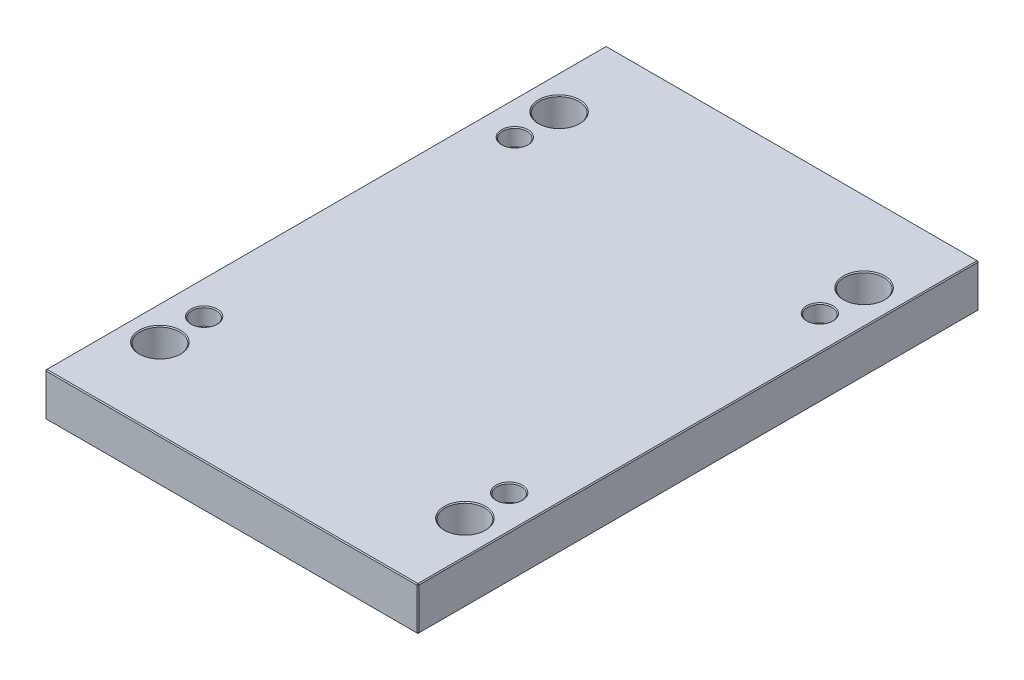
ISO-10303-21;
HEADER;
FILE_DESCRIPTION(('STEP AP214'),'2;1');
FILE_NAME('part.step','',(''),(''),'','','');
FILE_SCHEMA(('AUTOMOTIVE_DESIGN { 1 0 10303 214 1 1 1 1 }'));
ENDSEC;
DATA;
#1=APPLICATION_CONTEXT('core data for automotive mechanical design processes');
#2=APPLICATION_PROTOCOL_DEFINITION('international standard','automotive_design',2000,#1);
#3=PRODUCT_CONTEXT('',#1,'mechanical');
#4=PRODUCT('Part','Part','',(#3));
#5=PRODUCT_RELATED_PRODUCT_CATEGORY('part','',(#4));
#6=PRODUCT_DEFINITION_FORMATION('','',#4);
#7=PRODUCT_DEFINITION_CONTEXT('part definition',#1,'design');
#8=PRODUCT_DEFINITION('design','',#6,#7);
#9=PRODUCT_DEFINITION_SHAPE('','',#8);
#10=(LENGTH_UNIT() NAMED_UNIT(*) SI_UNIT(.MILLI.,.METRE.));
#11=(NAMED_UNIT(*) PLANE_ANGLE_UNIT() SI_UNIT($,.RADIAN.));
#12=(NAMED_UNIT(*) SI_UNIT($,.STERADIAN.) SOLID_ANGLE_UNIT());
#13=UNCERTAINTY_MEASURE_WITH_UNIT(LENGTH_MEASURE(1.E-05),#10,'distance_accuracy_value','');
#14=(GEOMETRIC_REPRESENTATION_CONTEXT(3) GLOBAL_UNCERTAINTY_ASSIGNED_CONTEXT((#13)) GLOBAL_UNIT_ASSIGNED_CONTEXT((#10,
#11,#12)) REPRESENTATION_CONTEXT('',''));
#15=CARTESIAN_POINT('',(0.,0.,0.));
#16=DIRECTION('',(0.,0.,1.));
#17=DIRECTION('',(1.,0.,0.));
#18=AXIS2_PLACEMENT_3D('',#15,#16,#17);
#19=CARTESIAN_POINT('',(-198.,46.,298.));
#20=DIRECTION('',(1.,0.,0.));
#21=DIRECTION('',(0.,0.,-1.));
#22=AXIS2_PLACEMENT_3D('',#19,#20,#21);
#23=PLANE('',#22);
#24=DIRECTION('',(0.,-1.,0.));
#25=VECTOR('',#24,1.);
#26=CARTESIAN_POINT('',(-198.,46.,-297.));
#27=LINE('',#26,#25);
#28=CARTESIAN_POINT('',(-198.,45.,-297.));
#29=VERTEX_POINT('',#28);
#30=CARTESIAN_POINT('',(-198.,1.,-297.));
#31=VERTEX_POINT('',#30);
#32=EDGE_CURVE('E115',#29,#31,#27,.T.);
#33=ORIENTED_EDGE('',*,*,#32,.T.);
#34=DIRECTION('',(0.,0.,1.));
#35=VECTOR('',#34,1.);
#36=CARTESIAN_POINT('',(-198.,1.,298.));
#37=LINE('',#36,#35);
#38=CARTESIAN_POINT('',(-198.,1.,297.));
#39=VERTEX_POINT('',#38);
#40=EDGE_CURVE('E111',#31,#39,#37,.T.);
#41=ORIENTED_EDGE('',*,*,#40,.T.);
#42=DIRECTION('',(0.,1.,0.));
#43=VECTOR('',#42,1.);
#44=CARTESIAN_POINT('',(-198.,46.,297.));
#45=LINE('',#44,#43);
#46=CARTESIAN_POINT('',(-198.,45.,297.));
#47=VERTEX_POINT('',#46);
#48=EDGE_CURVE('E104',#39,#47,#45,.T.);
#49=ORIENTED_EDGE('',*,*,#48,.T.);
#50=DIRECTION('',(0.,0.,-1.));
#51=VECTOR('',#50,1.);
#52=CARTESIAN_POINT('',(-198.,45.,-298.));
#53=LINE('',#52,#51);
#54=EDGE_CURVE('E108',#47,#29,#53,.T.);
#55=ORIENTED_EDGE('',*,*,#54,.T.);
#56=EDGE_LOOP('',(#33,#41,#49,#55));
#57=FACE_BOUND('',#56,.T.);
#58=ADVANCED_FACE('F16',(#57),#23,.F.);
#59=CARTESIAN_POINT('',(198.,46.,298.));
#60=DIRECTION('',(0.,0.,-1.));
#61=DIRECTION('',(-1.,0.,0.));
#62=AXIS2_PLACEMENT_3D('',#59,#60,#61);
#63=PLANE('',#62);
#64=DIRECTION('',(-1.,0.,0.));
#65=VECTOR('',#64,1.);
#66=CARTESIAN_POINT('',(-198.,45.,298.));
#67=LINE('',#66,#65);
#68=CARTESIAN_POINT('',(197.,45.,298.));
#69=VERTEX_POINT('',#68);
#70=CARTESIAN_POINT('',(-197.,45.,298.));
#71=VERTEX_POINT('',#70);
#72=EDGE_CURVE('E170',#69,#71,#67,.T.);
#73=ORIENTED_EDGE('',*,*,#72,.T.);
#74=DIRECTION('',(0.,-1.,0.));
#75=VECTOR('',#74,1.);
#76=CARTESIAN_POINT('',(-197.,46.,298.));
#77=LINE('',#76,#75);
#78=CARTESIAN_POINT('',(-197.,1.,298.));
#79=VERTEX_POINT('',#78);
#80=EDGE_CURVE('E123',#71,#79,#77,.T.);
#81=ORIENTED_EDGE('',*,*,#80,.T.);
#82=DIRECTION('',(1.,0.,0.));
#83=VECTOR('',#82,1.);
#84=CARTESIAN_POINT('',(198.,1.,298.));
#85=LINE('',#84,#83);
#86=CARTESIAN_POINT('',(197.,1.,298.));
#87=VERTEX_POINT('',#86);
#88=EDGE_CURVE('E174',#79,#87,#85,.T.);
#89=ORIENTED_EDGE('',*,*,#88,.T.);
#90=DIRECTION('',(0.,1.,0.));
#91=VECTOR('',#90,1.);
#92=CARTESIAN_POINT('',(197.,46.,298.));
#93=LINE('',#92,#91);
#94=EDGE_CURVE('E172',#87,#69,#93,.T.);
#95=ORIENTED_EDGE('',*,*,#94,.T.);
#96=EDGE_LOOP('',(#73,#81,#89,#95));
#97=FACE_BOUND('',#96,.T.);
#98=ADVANCED_FACE('F413',(#97),#63,.F.);
#99=CARTESIAN_POINT('',(198.,46.,298.));
#100=DIRECTION('',(-1.,0.,0.));
#101=DIRECTION('',(0.,0.,1.));
#102=AXIS2_PLACEMENT_3D('',#99,#100,#101);
#103=PLANE('',#102);
#104=DIRECTION('',(0.,0.,-1.));
#105=VECTOR('',#104,1.);
#106=CARTESIAN_POINT('',(198.,1.,298.));
#107=LINE('',#106,#105);
#108=CARTESIAN_POINT('',(198.,1.,297.));
#109=VERTEX_POINT('',#108);
#110=CARTESIAN_POINT('',(198.,1.,-297.));
#111=VERTEX_POINT('',#110);
#112=EDGE_CURVE('E165',#109,#111,#107,.T.);
#113=ORIENTED_EDGE('',*,*,#112,.T.);
#114=DIRECTION('',(0.,1.,0.));
#115=VECTOR('',#114,1.);
#116=CARTESIAN_POINT('',(198.,46.,-297.));
#117=LINE('',#116,#115);
#118=CARTESIAN_POINT('',(198.,45.,-297.));
#119=VERTEX_POINT('',#118);
#120=EDGE_CURVE('E167',#111,#119,#117,.T.);
#121=ORIENTED_EDGE('',*,*,#120,.T.);
#122=DIRECTION('',(0.,0.,1.));
#123=VECTOR('',#122,1.);
#124=CARTESIAN_POINT('',(198.,45.,298.));
#125=LINE('',#124,#123);
#126=CARTESIAN_POINT('',(198.,45.,297.));
#127=VERTEX_POINT('',#126);
#128=EDGE_CURVE('E161',#119,#127,#125,.T.);
#129=ORIENTED_EDGE('',*,*,#128,.T.);
#130=DIRECTION('',(0.,-1.,0.));
#131=VECTOR('',#130,1.);
#132=CARTESIAN_POINT('',(198.,46.,297.));
#133=LINE('',#132,#131);
#134=EDGE_CURVE('E163',#127,#109,#133,.T.);
#135=ORIENTED_EDGE('',*,*,#134,.T.);
#136=EDGE_LOOP('',(#113,#121,#129,#135));
#137=FACE_BOUND('',#136,.T.);
#138=ADVANCED_FACE('F406',(#137),#103,.F.);
#139=CARTESIAN_POINT('',(198.,46.,-298.));
#140=DIRECTION('',(0.,0.,1.));
#141=DIRECTION('',(1.,0.,0.));
#142=AXIS2_PLACEMENT_3D('',#139,#140,#141);
#143=PLANE('',#142);
#144=DIRECTION('',(0.,-1.,0.));
#145=VECTOR('',#144,1.);
#146=CARTESIAN_POINT('',(197.,46.,-298.));
#147=LINE('',#146,#145);
#148=CARTESIAN_POINT('',(197.,45.,-298.));
#149=VERTEX_POINT('',#148);
#150=CARTESIAN_POINT('',(197.,1.,-298.));
#151=VERTEX_POINT('',#150);
#152=EDGE_CURVE('E154',#149,#151,#147,.T.);
#153=ORIENTED_EDGE('',*,*,#152,.T.);
#154=DIRECTION('',(-1.,0.,0.));
#155=VECTOR('',#154,1.);
#156=CARTESIAN_POINT('',(198.,1.,-298.));
#157=LINE('',#156,#155);
#158=CARTESIAN_POINT('',(-197.,1.,-298.));
#159=VERTEX_POINT('',#158);
#160=EDGE_CURVE('E159',#151,#159,#157,.T.);
#161=ORIENTED_EDGE('',*,*,#160,.T.);
#162=DIRECTION('',(0.,1.,0.));
#163=VECTOR('',#162,1.);
#164=CARTESIAN_POINT('',(-197.,46.,-298.));
#165=LINE('',#164,#163);
#166=CARTESIAN_POINT('',(-197.,45.,-298.));
#167=VERTEX_POINT('',#166);
#168=EDGE_CURVE('E156',#159,#167,#165,.T.);
#169=ORIENTED_EDGE('',*,*,#168,.T.);
#170=DIRECTION('',(1.,0.,0.));
#171=VECTOR('',#170,1.);
#172=CARTESIAN_POINT('',(198.,45.,-298.));
#173=LINE('',#172,#171);
#174=EDGE_CURVE('E152',#167,#149,#173,.T.);
#175=ORIENTED_EDGE('',*,*,#174,.T.);
#176=EDGE_LOOP('',(#153,#161,#169,#175));
#177=FACE_BOUND('',#176,.T.);
#178=ADVANCED_FACE('F431',(#177),#143,.F.);
#179=CARTESIAN_POINT('',(0.,46.,0.));
#180=DIRECTION('',(0.,1.,0.));
#181=DIRECTION('',(0.,0.,1.));
#182=AXIS2_PLACEMENT_3D('',#179,#180,#181);
#183=PLANE('',#182);
#184=CARTESIAN_POINT('',(-162.,46.,212.));
#185=DIRECTION('',(0.,1.,0.));
#186=DIRECTION('',(0.,0.,1.));
#187=AXIS2_PLACEMENT_3D('',#184,#185,#186);
#188=CIRCLE('',#187,22.0000000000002);
#189=CARTESIAN_POINT('',(-162.,46.,234.));
#190=VERTEX_POINT('',#189);
#191=EDGE_CURVE('E317',#190,#190,#188,.F.);
#192=ORIENTED_EDGE('',*,*,#191,.T.);
#193=EDGE_LOOP('',(#192));
#194=FACE_BOUND('',#193,.T.);
#195=CARTESIAN_POINT('',(162.,46.,212.));
#196=DIRECTION('',(0.,1.,0.));
#197=DIRECTION('',(0.,0.,1.));
#198=AXIS2_PLACEMENT_3D('',#195,#196,#197);
#199=CIRCLE('',#198,22.0000000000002);
#200=CARTESIAN_POINT('',(162.,46.,234.));
#201=VERTEX_POINT('',#200);
#202=EDGE_CURVE('E314',#201,#201,#199,.F.);
#203=ORIENTED_EDGE('',*,*,#202,.T.);
#204=EDGE_LOOP('',(#203));
#205=FACE_BOUND('',#204,.T.);
#206=CARTESIAN_POINT('',(162.,46.,-212.));
#207=DIRECTION('',(0.,1.,0.));
#208=DIRECTION('',(0.,0.,1.));
#209=AXIS2_PLACEMENT_3D('',#206,#207,#208);
#210=CIRCLE('',#209,22.0000000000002);
#211=CARTESIAN_POINT('',(162.,46.,-190.));
#212=VERTEX_POINT('',#211);
#213=EDGE_CURVE('E311',#212,#212,#210,.F.);
#214=ORIENTED_EDGE('',*,*,#213,.T.);
#215=EDGE_LOOP('',(#214));
#216=FACE_BOUND('',#215,.T.);
#217=CARTESIAN_POINT('',(-162.,46.,-212.));
#218=DIRECTION('',(0.,1.,0.));
#219=DIRECTION('',(0.,0.,1.));
#220=AXIS2_PLACEMENT_3D('',#217,#218,#219);
#221=CIRCLE('',#220,22.0000000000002);
#222=CARTESIAN_POINT('',(-162.,46.,-190.));
#223=VERTEX_POINT('',#222);
#224=EDGE_CURVE('E308',#223,#223,#221,.F.);
#225=ORIENTED_EDGE('',*,*,#224,.T.);
#226=EDGE_LOOP('',(#225));
#227=FACE_BOUND('',#226,.T.);
#228=CARTESIAN_POINT('',(-162.,46.,165.));
#229=DIRECTION('',(0.,1.,0.));
#230=DIRECTION('',(0.,0.,1.));
#231=AXIS2_PLACEMENT_3D('',#228,#229,#230);
#232=CIRCLE('',#231,14.0000000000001);
#233=CARTESIAN_POINT('',(-162.,46.,179.));
#234=VERTEX_POINT('',#233);
#235=EDGE_CURVE('E290',#234,#234,#232,.F.);
#236=ORIENTED_EDGE('',*,*,#235,.T.);
#237=EDGE_LOOP('',(#236));
#238=FACE_BOUND('',#237,.T.);
#239=CARTESIAN_POINT('',(162.,46.,165.));
#240=DIRECTION('',(0.,1.,0.));
#241=DIRECTION('',(0.,0.,1.));
#242=AXIS2_PLACEMENT_3D('',#239,#240,#241);
#243=CIRCLE('',#242,14.0000000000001);
#244=CARTESIAN_POINT('',(162.,46.,179.));
#245=VERTEX_POINT('',#244);
#246=EDGE_CURVE('E287',#245,#245,#243,.F.);
#247=ORIENTED_EDGE('',*,*,#246,.T.);
#248=EDGE_LOOP('',(#247));
#249=FACE_BOUND('',#248,.T.);
#250=CARTESIAN_POINT('',(162.,46.,-165.));
#251=DIRECTION('',(0.,1.,0.));
#252=DIRECTION('',(0.,0.,1.));
#253=AXIS2_PLACEMENT_3D('',#250,#251,#252);
#254=CIRCLE('',#253,14.0000000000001);
#255=CARTESIAN_POINT('',(162.,46.,-151.));
#256=VERTEX_POINT('',#255);
#257=EDGE_CURVE('E284',#256,#256,#254,.F.);
#258=ORIENTED_EDGE('',*,*,#257,.T.);
#259=EDGE_LOOP('',(#258));
#260=FACE_BOUND('',#259,.T.);
#261=CARTESIAN_POINT('',(-162.,46.,-165.));
#262=DIRECTION('',(0.,1.,0.));
#263=DIRECTION('',(0.,0.,1.));
#264=AXIS2_PLACEMENT_3D('',#261,#262,#263);
#265=CIRCLE('',#264,14.0000000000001);
#266=CARTESIAN_POINT('',(-162.,46.,-151.));
#267=VERTEX_POINT('',#266);
#268=EDGE_CURVE('E281',#267,#267,#265,.F.);
#269=ORIENTED_EDGE('',*,*,#268,.T.);
#270=EDGE_LOOP('',(#269));
#271=FACE_BOUND('',#270,.T.);
#272=DIRECTION('',(0.,0.,-1.));
#273=VECTOR('',#272,1.);
#274=CARTESIAN_POINT('',(197.,46.,-298.));
#275=LINE('',#274,#273);
#276=CARTESIAN_POINT('',(197.,46.,297.));
#277=VERTEX_POINT('',#276);
#278=CARTESIAN_POINT('',(197.,46.,-297.));
#279=VERTEX_POINT('',#278);
#280=EDGE_CURVE('E31',#277,#279,#275,.T.);
#281=ORIENTED_EDGE('',*,*,#280,.T.);
#282=DIRECTION('',(-1.,0.,0.));
#283=VECTOR('',#282,1.);
#284=CARTESIAN_POINT('',(-198.,46.,-297.));
#285=LINE('',#284,#283);
#286=CARTESIAN_POINT('',(-197.,46.,-297.));
#287=VERTEX_POINT('',#286);
#288=EDGE_CURVE('E190',#279,#287,#285,.T.);
#289=ORIENTED_EDGE('',*,*,#288,.T.);
#290=DIRECTION('',(0.,0.,1.));
#291=VECTOR('',#290,1.);
#292=CARTESIAN_POINT('',(-197.,46.,298.));
#293=LINE('',#292,#291);
#294=CARTESIAN_POINT('',(-197.,46.,297.));
#295=VERTEX_POINT('',#294);
#296=EDGE_CURVE('E186',#287,#295,#293,.T.);
#297=ORIENTED_EDGE('',*,*,#296,.T.);
#298=DIRECTION('',(1.,0.,0.));
#299=VECTOR('',#298,1.);
#300=CARTESIAN_POINT('',(198.,46.,297.));
#301=LINE('',#300,#299);
#302=EDGE_CURVE('E36',#295,#277,#301,.T.);
#303=ORIENTED_EDGE('',*,*,#302,.T.);
#304=EDGE_LOOP('',(#281,#289,#297,#303));
#305=FACE_BOUND('',#304,.T.);
#306=ADVANCED_FACE('F357',(#194,#205,#216,#227,#238,#249,#260,#271,#305),#183,.T.);
#307=CARTESIAN_POINT('',(0.,0.,0.));
#308=DIRECTION('',(0.,1.,0.));
#309=DIRECTION('',(0.,0.,1.));
#310=AXIS2_PLACEMENT_3D('',#307,#308,#309);
#311=PLANE('',#310);
#312=CARTESIAN_POINT('',(-162.,0.,212.));
#313=DIRECTION('',(0.,1.,0.));
#314=DIRECTION('',(0.,0.,1.));
#315=AXIS2_PLACEMENT_3D('',#312,#313,#314);
#316=CIRCLE('',#315,22.);
#317=CARTESIAN_POINT('',(-162.,0.,234.));
#318=VERTEX_POINT('',#317);
#319=EDGE_CURVE('E329',#318,#318,#316,.T.);
#320=ORIENTED_EDGE('',*,*,#319,.T.);
#321=EDGE_LOOP('',(#320));
#322=FACE_BOUND('',#321,.T.);
#323=CARTESIAN_POINT('',(162.,0.,212.));
#324=DIRECTION('',(0.,1.,0.));
#325=DIRECTION('',(0.,0.,1.));
#326=AXIS2_PLACEMENT_3D('',#323,#324,#325);
#327=CIRCLE('',#326,22.);
#328=CARTESIAN_POINT('',(162.,0.,234.));
#329=VERTEX_POINT('',#328);
#330=EDGE_CURVE('E326',#329,#329,#327,.T.);
#331=ORIENTED_EDGE('',*,*,#330,.T.);
#332=EDGE_LOOP('',(#331));
#333=FACE_BOUND('',#332,.T.);
#334=CARTESIAN_POINT('',(162.,0.,-212.));
#335=DIRECTION('',(0.,1.,0.));
#336=DIRECTION('',(0.,0.,1.));
#337=AXIS2_PLACEMENT_3D('',#334,#335,#336);
#338=CIRCLE('',#337,22.);
#339=CARTESIAN_POINT('',(162.,0.,-190.));
#340=VERTEX_POINT('',#339);
#341=EDGE_CURVE('E323',#340,#340,#338,.T.);
#342=ORIENTED_EDGE('',*,*,#341,.T.);
#343=EDGE_LOOP('',(#342));
#344=FACE_BOUND('',#343,.T.);
#345=CARTESIAN_POINT('',(-162.,0.,-212.));
#346=DIRECTION('',(0.,1.,0.));
#347=DIRECTION('',(0.,0.,1.));
#348=AXIS2_PLACEMENT_3D('',#345,#346,#347);
#349=CIRCLE('',#348,22.);
#350=CARTESIAN_POINT('',(-162.,0.,-190.));
#351=VERTEX_POINT('',#350);
#352=EDGE_CURVE('E320',#351,#351,#349,.T.);
#353=ORIENTED_EDGE('',*,*,#352,.T.);
#354=EDGE_LOOP('',(#353));
#355=FACE_BOUND('',#354,.T.);
#356=CARTESIAN_POINT('',(162.,0.,-165.));
#357=DIRECTION('',(0.,1.,0.));
#358=DIRECTION('',(0.,0.,1.));
#359=AXIS2_PLACEMENT_3D('',#356,#357,#358);
#360=CIRCLE('',#359,10.0000000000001);
#361=CARTESIAN_POINT('',(162.,0.,-155.));
#362=VERTEX_POINT('',#361);
#363=EDGE_CURVE('E263',#362,#362,#360,.T.);
#364=ORIENTED_EDGE('',*,*,#363,.T.);
#365=EDGE_LOOP('',(#364));
#366=FACE_BOUND('',#365,.T.);
#367=CARTESIAN_POINT('',(162.,0.,165.));
#368=DIRECTION('',(0.,1.,0.));
#369=DIRECTION('',(0.,0.,1.));
#370=AXIS2_PLACEMENT_3D('',#367,#368,#369);
#371=CIRCLE('',#370,10.0000000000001);
#372=CARTESIAN_POINT('',(162.,0.,175.));
#373=VERTEX_POINT('',#372);
#374=EDGE_CURVE('E260',#373,#373,#371,.T.);
#375=ORIENTED_EDGE('',*,*,#374,.T.);
#376=EDGE_LOOP('',(#375));
#377=FACE_BOUND('',#376,.T.);
#378=CARTESIAN_POINT('',(-162.,0.,165.));
#379=DIRECTION('',(0.,1.,0.));
#380=DIRECTION('',(0.,0.,1.));
#381=AXIS2_PLACEMENT_3D('',#378,#379,#380);
#382=CIRCLE('',#381,10.0000000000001);
#383=CARTESIAN_POINT('',(-162.,0.,175.));
#384=VERTEX_POINT('',#383);
#385=EDGE_CURVE('E257',#384,#384,#382,.T.);
#386=ORIENTED_EDGE('',*,*,#385,.T.);
#387=EDGE_LOOP('',(#386));
#388=FACE_BOUND('',#387,.T.);
#389=CARTESIAN_POINT('',(-162.,0.,-165.));
#390=DIRECTION('',(0.,1.,0.));
#391=DIRECTION('',(0.,0.,1.));
#392=AXIS2_PLACEMENT_3D('',#389,#390,#391);
#393=CIRCLE('',#392,10.0000000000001);
#394=CARTESIAN_POINT('',(-162.,0.,-155.));
#395=VERTEX_POINT('',#394);
#396=EDGE_CURVE('E192',#395,#395,#393,.T.);
#397=ORIENTED_EDGE('',*,*,#396,.T.);
#398=EDGE_LOOP('',(#397));
#399=FACE_BOUND('',#398,.T.);
#400=DIRECTION('',(0.,0.,1.));
#401=VECTOR('',#400,1.);
#402=CARTESIAN_POINT('',(197.,0.,0.));
#403=LINE('',#402,#401);
#404=CARTESIAN_POINT('',(197.,0.,-297.));
#405=VERTEX_POINT('',#404);
#406=CARTESIAN_POINT('',(197.,0.,297.));
#407=VERTEX_POINT('',#406);
#408=EDGE_CURVE('E177',#405,#407,#403,.T.);
#409=ORIENTED_EDGE('',*,*,#408,.T.);
#410=DIRECTION('',(-1.,0.,0.));
#411=VECTOR('',#410,1.);
#412=CARTESIAN_POINT('',(0.,0.,297.));
#413=LINE('',#412,#411);
#414=CARTESIAN_POINT('',(-197.,0.,297.));
#415=VERTEX_POINT('',#414);
#416=EDGE_CURVE('E183',#407,#415,#413,.T.);
#417=ORIENTED_EDGE('',*,*,#416,.T.);
#418=DIRECTION('',(0.,0.,-1.));
#419=VECTOR('',#418,1.);
#420=CARTESIAN_POINT('',(-197.,0.,0.));
#421=LINE('',#420,#419);
#422=CARTESIAN_POINT('',(-197.,0.,-297.));
#423=VERTEX_POINT('',#422);
#424=EDGE_CURVE('E181',#415,#423,#421,.T.);
#425=ORIENTED_EDGE('',*,*,#424,.T.);
#426=DIRECTION('',(1.,0.,0.));
#427=VECTOR('',#426,1.);
#428=CARTESIAN_POINT('',(0.,0.,-297.));
#429=LINE('',#428,#427);
#430=EDGE_CURVE('E179',#423,#405,#429,.T.);
#431=ORIENTED_EDGE('',*,*,#430,.T.);
#432=EDGE_LOOP('',(#409,#417,#425,#431));
#433=FACE_BOUND('',#432,.T.);
#434=ADVANCED_FACE('F353',(#322,#333,#344,#355,#366,#377,#388,#399,#433),#311,.F.);
#435=CARTESIAN_POINT('',(198.,46.,297.));
#436=DIRECTION('',(-0.707106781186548,0.,-0.707106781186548));
#437=DIRECTION('',(0.,-1.,0.));
#438=AXIS2_PLACEMENT_3D('',#435,#436,#437);
#439=PLANE('',#438);
#440=DIRECTION('',(-0.707106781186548,0.,0.707106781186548));
#441=VECTOR('',#440,1.);
#442=CARTESIAN_POINT('',(197.,45.,298.));
#443=LINE('',#442,#441);
#444=EDGE_CURVE('E141',#69,#127,#443,.F.);
#445=ORIENTED_EDGE('',*,*,#444,.F.);
#446=ORIENTED_EDGE('',*,*,#94,.F.);
#447=DIRECTION('',(0.707106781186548,0.,-0.707106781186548));
#448=VECTOR('',#447,1.);
#449=CARTESIAN_POINT('',(197.,1.,298.));
#450=LINE('',#449,#448);
#451=EDGE_CURVE('E144',#109,#87,#450,.F.);
#452=ORIENTED_EDGE('',*,*,#451,.F.);
#453=ORIENTED_EDGE('',*,*,#134,.F.);
#454=EDGE_LOOP('',(#445,#446,#452,#453));
#455=FACE_BOUND('',#454,.T.);
#456=ADVANCED_FACE('F356',(#455),#439,.F.);
#457=CARTESIAN_POINT('',(197.,45.,298.));
#458=DIRECTION('',(0.577350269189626,0.577350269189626,0.577350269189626));
#459=DIRECTION('',(0.707106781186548,0.,-0.707106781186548));
#460=AXIS2_PLACEMENT_3D('',#457,#458,#459);
#461=PLANE('',#460);
#462=DIRECTION('',(0.,-0.707106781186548,0.707106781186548));
#463=VECTOR('',#462,1.);
#464=CARTESIAN_POINT('',(197.,45.,298.));
#465=LINE('',#464,#463);
#466=EDGE_CURVE('E235',#69,#277,#465,.F.);
#467=ORIENTED_EDGE('',*,*,#466,.F.);
#468=ORIENTED_EDGE('',*,*,#444,.T.);
#469=DIRECTION('',(-0.707106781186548,0.707106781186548,0.));
#470=VECTOR('',#469,1.);
#471=CARTESIAN_POINT('',(197.5,45.5,297.));
#472=LINE('',#471,#470);
#473=EDGE_CURVE('E237',#277,#127,#472,.F.);
#474=ORIENTED_EDGE('',*,*,#473,.F.);
#475=EDGE_LOOP('',(#467,#468,#474));
#476=FACE_BOUND('',#475,.T.);
#477=ADVANCED_FACE('F419',(#476),#461,.T.);
#478=CARTESIAN_POINT('',(197.,1.,298.));
#479=DIRECTION('',(0.577350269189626,-0.577350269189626,0.577350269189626));
#480=DIRECTION('',(0.707106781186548,0.,-0.707106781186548));
#481=AXIS2_PLACEMENT_3D('',#478,#479,#480);
#482=PLANE('',#481);
#483=DIRECTION('',(-0.707106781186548,-0.707106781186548,0.));
#484=VECTOR('',#483,1.);
#485=CARTESIAN_POINT('',(197.5,0.5,297.));
#486=LINE('',#485,#484);
#487=EDGE_CURVE('E229',#109,#407,#486,.T.);
#488=ORIENTED_EDGE('',*,*,#487,.F.);
#489=ORIENTED_EDGE('',*,*,#451,.T.);
#490=DIRECTION('',(0.,0.707106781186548,0.707106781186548));
#491=VECTOR('',#490,1.);
#492=CARTESIAN_POINT('',(197.,1.,298.));
#493=LINE('',#492,#491);
#494=EDGE_CURVE('E232',#407,#87,#493,.T.);
#495=ORIENTED_EDGE('',*,*,#494,.F.);
#496=EDGE_LOOP('',(#488,#489,#495));
#497=FACE_BOUND('',#496,.T.);
#498=ADVANCED_FACE('F378',(#497),#482,.T.);
#499=CARTESIAN_POINT('',(197.,46.,0.));
#500=DIRECTION('',(0.707106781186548,0.707106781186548,0.));
#501=DIRECTION('',(0.,0.,1.));
#502=AXIS2_PLACEMENT_3D('',#499,#500,#501);
#503=PLANE('',#502);
#504=ORIENTED_EDGE('',*,*,#473,.T.);
#505=ORIENTED_EDGE('',*,*,#128,.F.);
#506=DIRECTION('',(0.707106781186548,-0.707106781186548,0.));
#507=VECTOR('',#506,1.);
#508=CARTESIAN_POINT('',(198.,45.,-297.));
#509=LINE('',#508,#507);
#510=EDGE_CURVE('E224',#279,#119,#509,.T.);
#511=ORIENTED_EDGE('',*,*,#510,.F.);
#512=ORIENTED_EDGE('',*,*,#280,.F.);
#513=EDGE_LOOP('',(#504,#505,#511,#512));
#514=FACE_BOUND('',#513,.T.);
#515=ADVANCED_FACE('F421',(#514),#503,.T.);
#516=CARTESIAN_POINT('',(0.,46.,297.));
#517=DIRECTION('',(0.,0.707106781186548,0.707106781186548));
#518=DIRECTION('',(-1.,0.,0.));
#519=AXIS2_PLACEMENT_3D('',#516,#517,#518);
#520=PLANE('',#519);
#521=ORIENTED_EDGE('',*,*,#466,.T.);
#522=ORIENTED_EDGE('',*,*,#302,.F.);
#523=DIRECTION('',(0.,0.707106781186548,-0.707106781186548));
#524=VECTOR('',#523,1.);
#525=CARTESIAN_POINT('',(-197.,45.5,297.5));
#526=LINE('',#525,#524);
#527=EDGE_CURVE('E127',#71,#295,#526,.T.);
#528=ORIENTED_EDGE('',*,*,#527,.F.);
#529=ORIENTED_EDGE('',*,*,#72,.F.);
#530=EDGE_LOOP('',(#521,#522,#528,#529));
#531=FACE_BOUND('',#530,.T.);
#532=ADVANCED_FACE('F416',(#531),#520,.T.);
#533=CARTESIAN_POINT('',(-197.,46.,298.));
#534=DIRECTION('',(0.707106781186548,0.,-0.707106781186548));
#535=DIRECTION('',(0.,-1.,0.));
#536=AXIS2_PLACEMENT_3D('',#533,#534,#535);
#537=PLANE('',#536);
#538=DIRECTION('',(0.707106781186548,0.,0.707106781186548));
#539=VECTOR('',#538,1.);
#540=CARTESIAN_POINT('',(-197.,1.,298.));
#541=LINE('',#540,#539);
#542=EDGE_CURVE('E128',#79,#39,#541,.F.);
#543=ORIENTED_EDGE('',*,*,#542,.F.);
#544=ORIENTED_EDGE('',*,*,#80,.F.);
#545=DIRECTION('',(-0.707106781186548,0.,-0.707106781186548));
#546=VECTOR('',#545,1.);
#547=CARTESIAN_POINT('',(-198.,45.,297.));
#548=LINE('',#547,#546);
#549=EDGE_CURVE('E119',#47,#71,#548,.F.);
#550=ORIENTED_EDGE('',*,*,#549,.F.);
#551=ORIENTED_EDGE('',*,*,#48,.F.);
#552=EDGE_LOOP('',(#543,#544,#550,#551));
#553=FACE_BOUND('',#552,.T.);
#554=ADVANCED_FACE('F121',(#553),#537,.F.);
#555=CARTESIAN_POINT('',(198.,1.,298.));
#556=DIRECTION('',(0.,0.707106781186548,-0.707106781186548));
#557=DIRECTION('',(1.,0.,0.));
#558=AXIS2_PLACEMENT_3D('',#555,#556,#557);
#559=PLANE('',#558);
#560=ORIENTED_EDGE('',*,*,#494,.T.);
#561=ORIENTED_EDGE('',*,*,#88,.F.);
#562=DIRECTION('',(0.,-0.707106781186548,-0.707106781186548));
#563=VECTOR('',#562,1.);
#564=CARTESIAN_POINT('',(-197.,1.,298.));
#565=LINE('',#564,#563);
#566=EDGE_CURVE('E220',#415,#79,#565,.F.);
#567=ORIENTED_EDGE('',*,*,#566,.F.);
#568=ORIENTED_EDGE('',*,*,#416,.F.);
#569=EDGE_LOOP('',(#560,#561,#567,#568));
#570=FACE_BOUND('',#569,.T.);
#571=ADVANCED_FACE('F383',(#570),#559,.F.);
#572=CARTESIAN_POINT('',(198.,1.,298.));
#573=DIRECTION('',(-0.707106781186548,0.707106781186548,0.));
#574=DIRECTION('',(0.,0.,-1.));
#575=AXIS2_PLACEMENT_3D('',#572,#573,#574);
#576=PLANE('',#575);
#577=ORIENTED_EDGE('',*,*,#487,.T.);
#578=ORIENTED_EDGE('',*,*,#408,.F.);
#579=DIRECTION('',(0.707106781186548,0.707106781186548,0.));
#580=VECTOR('',#579,1.);
#581=CARTESIAN_POINT('',(197.5,0.500000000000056,-297.));
#582=LINE('',#581,#580);
#583=EDGE_CURVE('E217',#111,#405,#582,.F.);
#584=ORIENTED_EDGE('',*,*,#583,.F.);
#585=ORIENTED_EDGE('',*,*,#112,.F.);
#586=EDGE_LOOP('',(#577,#578,#584,#585));
#587=FACE_BOUND('',#586,.T.);
#588=ADVANCED_FACE('F376',(#587),#576,.F.);
#589=CARTESIAN_POINT('',(197.,46.,-298.));
#590=DIRECTION('',(-0.707106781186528,0.,0.707106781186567));
#591=DIRECTION('',(0.,-1.,0.));
#592=AXIS2_PLACEMENT_3D('',#589,#590,#591);
#593=PLANE('',#592);
#594=DIRECTION('',(0.707106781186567,0.,0.707106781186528));
#595=VECTOR('',#594,1.);
#596=CARTESIAN_POINT('',(198.,45.,-297.));
#597=LINE('',#596,#595);
#598=EDGE_CURVE('E226',#119,#149,#597,.F.);
#599=ORIENTED_EDGE('',*,*,#598,.F.);
#600=ORIENTED_EDGE('',*,*,#120,.F.);
#601=DIRECTION('',(-0.707106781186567,0.,-0.707106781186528));
#602=VECTOR('',#601,1.);
#603=CARTESIAN_POINT('',(197.,1.,-298.));
#604=LINE('',#603,#602);
#605=EDGE_CURVE('E214',#151,#111,#604,.F.);
#606=ORIENTED_EDGE('',*,*,#605,.F.);
#607=ORIENTED_EDGE('',*,*,#152,.F.);
#608=EDGE_LOOP('',(#599,#600,#606,#607));
#609=FACE_BOUND('',#608,.T.);
#610=ADVANCED_FACE('F403',(#609),#593,.F.);
#611=CARTESIAN_POINT('',(198.,45.,-297.));
#612=DIRECTION('',(0.577350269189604,0.577350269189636,-0.577350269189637));
#613=DIRECTION('',(0.,0.707106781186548,0.707106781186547));
#614=AXIS2_PLACEMENT_3D('',#611,#612,#613);
#615=PLANE('',#614);
#616=ORIENTED_EDGE('',*,*,#510,.T.);
#617=ORIENTED_EDGE('',*,*,#598,.T.);
#618=DIRECTION('',(0.,0.707106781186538,0.707106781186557));
#619=VECTOR('',#618,1.);
#620=CARTESIAN_POINT('',(197.,45.5,-297.5));
#621=LINE('',#620,#619);
#622=EDGE_CURVE('E135',#279,#149,#621,.F.);
#623=ORIENTED_EDGE('',*,*,#622,.F.);
#624=EDGE_LOOP('',(#616,#617,#623));
#625=FACE_BOUND('',#624,.T.);
#626=ADVANCED_FACE('F425',(#625),#615,.T.);
#627=CARTESIAN_POINT('',(-198.,45.,297.));
#628=DIRECTION('',(-0.577350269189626,0.577350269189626,0.577350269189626));
#629=DIRECTION('',(0.707106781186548,0.,0.707106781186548));
#630=AXIS2_PLACEMENT_3D('',#627,#628,#629);
#631=PLANE('',#630);
#632=ORIENTED_EDGE('',*,*,#549,.T.);
#633=ORIENTED_EDGE('',*,*,#527,.T.);
#634=DIRECTION('',(-0.707106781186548,-0.707106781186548,0.));
#635=VECTOR('',#634,1.);
#636=CARTESIAN_POINT('',(-198.,45.,297.));
#637=LINE('',#636,#635);
#638=EDGE_CURVE('E131',#47,#295,#637,.F.);
#639=ORIENTED_EDGE('',*,*,#638,.F.);
#640=EDGE_LOOP('',(#632,#633,#639));
#641=FACE_BOUND('',#640,.T.);
#642=ADVANCED_FACE('F132',(#641),#631,.T.);
#643=CARTESIAN_POINT('',(-197.,1.,298.));
#644=DIRECTION('',(-0.577350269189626,-0.577350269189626,0.577350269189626));
#645=DIRECTION('',(0.707106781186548,0.,0.707106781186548));
#646=AXIS2_PLACEMENT_3D('',#643,#644,#645);
#647=PLANE('',#646);
#648=ORIENTED_EDGE('',*,*,#566,.T.);
#649=ORIENTED_EDGE('',*,*,#542,.T.);
#650=DIRECTION('',(-0.707106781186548,0.707106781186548,0.));
#651=VECTOR('',#650,1.);
#652=CARTESIAN_POINT('',(-197.5,0.5,297.));
#653=LINE('',#652,#651);
#654=EDGE_CURVE('E136',#415,#39,#653,.T.);
#655=ORIENTED_EDGE('',*,*,#654,.F.);
#656=EDGE_LOOP('',(#648,#649,#655));
#657=FACE_BOUND('',#656,.T.);
#658=ADVANCED_FACE('F386',(#657),#647,.T.);
#659=CARTESIAN_POINT('',(197.,1.,-298.));
#660=DIRECTION('',(0.577350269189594,-0.577350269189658,-0.577350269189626));
#661=DIRECTION('',(0.,0.707106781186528,-0.707106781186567));
#662=AXIS2_PLACEMENT_3D('',#659,#660,#661);
#663=PLANE('',#662);
#664=ORIENTED_EDGE('',*,*,#605,.T.);
#665=ORIENTED_EDGE('',*,*,#583,.T.);
#666=DIRECTION('',(0.,-0.707106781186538,0.707106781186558));
#667=VECTOR('',#666,1.);
#668=CARTESIAN_POINT('',(197.,1.,-298.));
#669=LINE('',#668,#667);
#670=EDGE_CURVE('E207',#151,#405,#669,.T.);
#671=ORIENTED_EDGE('',*,*,#670,.F.);
#672=EDGE_LOOP('',(#664,#665,#671));
#673=FACE_BOUND('',#672,.T.);
#674=ADVANCED_FACE('F397',(#673),#663,.T.);
#675=CARTESIAN_POINT('',(0.,46.,-297.));
#676=DIRECTION('',(0.,0.707106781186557,-0.707106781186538));
#677=DIRECTION('',(1.,0.,0.));
#678=AXIS2_PLACEMENT_3D('',#675,#676,#677);
#679=PLANE('',#678);
#680=ORIENTED_EDGE('',*,*,#622,.T.);
#681=ORIENTED_EDGE('',*,*,#174,.F.);
#682=DIRECTION('',(0.,-0.707106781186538,-0.707106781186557));
#683=VECTOR('',#682,1.);
#684=CARTESIAN_POINT('',(-197.,45.,-298.));
#685=LINE('',#684,#683);
#686=EDGE_CURVE('E204',#287,#167,#685,.T.);
#687=ORIENTED_EDGE('',*,*,#686,.F.);
#688=ORIENTED_EDGE('',*,*,#288,.F.);
#689=EDGE_LOOP('',(#680,#681,#687,#688));
#690=FACE_BOUND('',#689,.T.);
#691=ADVANCED_FACE('F429',(#690),#679,.T.);
#692=CARTESIAN_POINT('',(-197.,46.,0.));
#693=DIRECTION('',(-0.707106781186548,0.707106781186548,0.));
#694=DIRECTION('',(0.,0.,-1.));
#695=AXIS2_PLACEMENT_3D('',#692,#693,#694);
#696=PLANE('',#695);
#697=ORIENTED_EDGE('',*,*,#638,.T.);
#698=ORIENTED_EDGE('',*,*,#296,.F.);
#699=DIRECTION('',(0.707106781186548,0.707106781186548,0.));
#700=VECTOR('',#699,1.);
#701=CARTESIAN_POINT('',(-197.5,45.5,-297.));
#702=LINE('',#701,#700);
#703=EDGE_CURVE('E139',#29,#287,#702,.T.);
#704=ORIENTED_EDGE('',*,*,#703,.F.);
#705=ORIENTED_EDGE('',*,*,#54,.F.);
#706=EDGE_LOOP('',(#697,#698,#704,#705));
#707=FACE_BOUND('',#706,.T.);
#708=ADVANCED_FACE('F138',(#707),#696,.T.);
#709=CARTESIAN_POINT('',(-198.,1.,298.));
#710=DIRECTION('',(0.707106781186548,0.707106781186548,0.));
#711=DIRECTION('',(0.,0.,1.));
#712=AXIS2_PLACEMENT_3D('',#709,#710,#711);
#713=PLANE('',#712);
#714=ORIENTED_EDGE('',*,*,#654,.T.);
#715=ORIENTED_EDGE('',*,*,#40,.F.);
#716=DIRECTION('',(0.707106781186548,-0.707106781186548,1.17611407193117E-13));
#717=VECTOR('',#716,1.);
#718=CARTESIAN_POINT('',(-198.,1.,-297.));
#719=LINE('',#718,#717);
#720=EDGE_CURVE('E200',#423,#31,#719,.F.);
#721=ORIENTED_EDGE('',*,*,#720,.F.);
#722=ORIENTED_EDGE('',*,*,#424,.F.);
#723=EDGE_LOOP('',(#714,#715,#721,#722));
#724=FACE_BOUND('',#723,.T.);
#725=ADVANCED_FACE('F388',(#724),#713,.F.);
#726=CARTESIAN_POINT('',(198.,1.,-298.));
#727=DIRECTION('',(0.,0.707106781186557,0.707106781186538));
#728=DIRECTION('',(-1.,0.,0.));
#729=AXIS2_PLACEMENT_3D('',#726,#727,#728);
#730=PLANE('',#729);
#731=ORIENTED_EDGE('',*,*,#670,.T.);
#732=ORIENTED_EDGE('',*,*,#430,.F.);
#733=DIRECTION('',(0.,0.707106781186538,-0.707106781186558));
#734=VECTOR('',#733,1.);
#735=CARTESIAN_POINT('',(-197.,0.50000000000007,-297.5));
#736=LINE('',#735,#734);
#737=EDGE_CURVE('E197',#159,#423,#736,.F.);
#738=ORIENTED_EDGE('',*,*,#737,.F.);
#739=ORIENTED_EDGE('',*,*,#160,.F.);
#740=EDGE_LOOP('',(#731,#732,#738,#739));
#741=FACE_BOUND('',#740,.T.);
#742=ADVANCED_FACE('F392',(#741),#730,.F.);
#743=CARTESIAN_POINT('',(-197.,45.,-298.));
#744=DIRECTION('',(-0.577350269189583,0.577350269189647,-0.577350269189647));
#745=DIRECTION('',(0.,0.707106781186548,0.707106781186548));
#746=AXIS2_PLACEMENT_3D('',#743,#744,#745);
#747=PLANE('',#746);
#748=ORIENTED_EDGE('',*,*,#703,.T.);
#749=ORIENTED_EDGE('',*,*,#686,.T.);
#750=DIRECTION('',(0.707106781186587,0.,-0.707106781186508));
#751=VECTOR('',#750,1.);
#752=CARTESIAN_POINT('',(-197.,45.,-298.));
#753=LINE('',#752,#751);
#754=EDGE_CURVE('E195',#29,#167,#753,.T.);
#755=ORIENTED_EDGE('',*,*,#754,.F.);
#756=EDGE_LOOP('',(#748,#749,#755));
#757=FACE_BOUND('',#756,.T.);
#758=ADVANCED_FACE('F460',(#757),#747,.T.);
#759=CARTESIAN_POINT('',(-198.,1.,-297.));
#760=DIRECTION('',(-0.577350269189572,-0.577350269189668,-0.577350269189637));
#761=DIRECTION('',(0.,0.707106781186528,-0.707106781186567));
#762=AXIS2_PLACEMENT_3D('',#759,#760,#761);
#763=PLANE('',#762);
#764=ORIENTED_EDGE('',*,*,#737,.T.);
#765=ORIENTED_EDGE('',*,*,#720,.T.);
#766=DIRECTION('',(-0.707106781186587,0.,0.707106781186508));
#767=VECTOR('',#766,1.);
#768=CARTESIAN_POINT('',(-198.,1.,-297.));
#769=LINE('',#768,#767);
#770=EDGE_CURVE('E193',#159,#31,#769,.T.);
#771=ORIENTED_EDGE('',*,*,#770,.F.);
#772=EDGE_LOOP('',(#764,#765,#771));
#773=FACE_BOUND('',#772,.T.);
#774=ADVANCED_FACE('F456',(#773),#763,.T.);
#775=CARTESIAN_POINT('',(-198.,46.,-297.));
#776=DIRECTION('',(0.707106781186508,0.,0.707106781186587));
#777=DIRECTION('',(0.,-1.,0.));
#778=AXIS2_PLACEMENT_3D('',#775,#776,#777);
#779=PLANE('',#778);
#780=ORIENTED_EDGE('',*,*,#754,.T.);
#781=ORIENTED_EDGE('',*,*,#168,.F.);
#782=ORIENTED_EDGE('',*,*,#770,.T.);
#783=ORIENTED_EDGE('',*,*,#32,.F.);
#784=EDGE_LOOP('',(#780,#781,#782,#783));
#785=FACE_BOUND('',#784,.T.);
#786=ADVANCED_FACE('F452',(#785),#779,.F.);
#787=CARTESIAN_POINT('',(-162.,28.,-165.));
#788=DIRECTION('',(0.,1.,0.));
#789=DIRECTION('',(0.,0.,1.));
#790=AXIS2_PLACEMENT_3D('',#787,#788,#789);
#791=CYLINDRICAL_SURFACE('',#790,13.);
#792=CARTESIAN_POINT('',(-162.,45.,-165.));
#793=DIRECTION('',(0.,1.,0.));
#794=DIRECTION('',(0.,0.,1.));
#795=AXIS2_PLACEMENT_3D('',#792,#793,#794);
#796=CIRCLE('',#795,13.);
#797=CARTESIAN_POINT('',(-162.,45.,-152.));
#798=VERTEX_POINT('',#797);
#799=EDGE_CURVE('E299',#798,#798,#796,.T.);
#800=ORIENTED_EDGE('',*,*,#799,.T.);
#801=EDGE_LOOP('',(#800));
#802=FACE_BOUND('',#801,.T.);
#803=CARTESIAN_POINT('',(-162.,28.,-165.));
#804=DIRECTION('',(0.,1.,0.));
#805=DIRECTION('',(0.,0.,1.));
#806=AXIS2_PLACEMENT_3D('',#803,#804,#805);
#807=CIRCLE('',#806,13.);
#808=CARTESIAN_POINT('',(-162.,28.,-152.));
#809=VERTEX_POINT('',#808);
#810=EDGE_CURVE('E147',#809,#809,#807,.T.);
#811=ORIENTED_EDGE('',*,*,#810,.F.);
#812=EDGE_LOOP('',(#811));
#813=FACE_BOUND('',#812,.T.);
#814=ADVANCED_FACE('F455',(#802,#813),#791,.F.);
#815=CARTESIAN_POINT('',(-162.,28.,-165.));
#816=DIRECTION('',(0.,1.,0.));
#817=DIRECTION('',(0.,0.,1.));
#818=AXIS2_PLACEMENT_3D('',#815,#816,#817);
#819=PLANE('',#818);
#820=CARTESIAN_POINT('',(-162.,28.,-165.));
#821=DIRECTION('',(0.,1.,0.));
#822=DIRECTION('',(0.,0.,1.));
#823=AXIS2_PLACEMENT_3D('',#820,#821,#822);
#824=CIRCLE('',#823,9.);
#825=CARTESIAN_POINT('',(-162.,28.,-156.));
#826=VERTEX_POINT('',#825);
#827=EDGE_CURVE('E251',#826,#826,#824,.T.);
#828=ORIENTED_EDGE('',*,*,#827,.F.);
#829=EDGE_LOOP('',(#828));
#830=FACE_BOUND('',#829,.T.);
#831=ORIENTED_EDGE('',*,*,#810,.T.);
#832=EDGE_LOOP('',(#831));
#833=FACE_BOUND('',#832,.T.);
#834=ADVANCED_FACE('F602',(#830,#833),#819,.T.);
#835=CARTESIAN_POINT('',(162.,28.,-165.));
#836=DIRECTION('',(0.,1.,0.));
#837=DIRECTION('',(0.,0.,1.));
#838=AXIS2_PLACEMENT_3D('',#835,#836,#837);
#839=CYLINDRICAL_SURFACE('',#838,13.);
#840=CARTESIAN_POINT('',(162.,45.,-165.));
#841=DIRECTION('',(0.,1.,0.));
#842=DIRECTION('',(0.,0.,1.));
#843=AXIS2_PLACEMENT_3D('',#840,#841,#842);
#844=CIRCLE('',#843,13.);
#845=CARTESIAN_POINT('',(162.,45.,-152.));
#846=VERTEX_POINT('',#845);
#847=EDGE_CURVE('E296',#846,#846,#844,.T.);
#848=ORIENTED_EDGE('',*,*,#847,.T.);
#849=EDGE_LOOP('',(#848));
#850=FACE_BOUND('',#849,.T.);
#851=CARTESIAN_POINT('',(162.,28.,-165.));
#852=DIRECTION('',(0.,1.,0.));
#853=DIRECTION('',(0.,0.,1.));
#854=AXIS2_PLACEMENT_3D('',#851,#852,#853);
#855=CIRCLE('',#854,13.);
#856=CARTESIAN_POINT('',(162.,28.,-152.));
#857=VERTEX_POINT('',#856);
#858=EDGE_CURVE('E630',#857,#857,#855,.T.);
#859=ORIENTED_EDGE('',*,*,#858,.F.);
#860=EDGE_LOOP('',(#859));
#861=FACE_BOUND('',#860,.T.);
#862=ADVANCED_FACE('F598',(#850,#861),#839,.F.);
#863=CARTESIAN_POINT('',(162.,28.,-165.));
#864=DIRECTION('',(0.,1.,0.));
#865=DIRECTION('',(0.,0.,1.));
#866=AXIS2_PLACEMENT_3D('',#863,#864,#865);
#867=PLANE('',#866);
#868=CARTESIAN_POINT('',(162.,28.,-165.));
#869=DIRECTION('',(0.,1.,0.));
#870=DIRECTION('',(0.,0.,1.));
#871=AXIS2_PLACEMENT_3D('',#868,#869,#870);
#872=CIRCLE('',#871,9.);
#873=CARTESIAN_POINT('',(162.,28.,-156.));
#874=VERTEX_POINT('',#873);
#875=EDGE_CURVE('E248',#874,#874,#872,.T.);
#876=ORIENTED_EDGE('',*,*,#875,.F.);
#877=EDGE_LOOP('',(#876));
#878=FACE_BOUND('',#877,.T.);
#879=ORIENTED_EDGE('',*,*,#858,.T.);
#880=EDGE_LOOP('',(#879));
#881=FACE_BOUND('',#880,.T.);
#882=ADVANCED_FACE('F594',(#878,#881),#867,.T.);
#883=CARTESIAN_POINT('',(162.,28.,165.));
#884=DIRECTION('',(0.,1.,0.));
#885=DIRECTION('',(0.,0.,1.));
#886=AXIS2_PLACEMENT_3D('',#883,#884,#885);
#887=CYLINDRICAL_SURFACE('',#886,13.);
#888=CARTESIAN_POINT('',(162.,45.,165.));
#889=DIRECTION('',(0.,1.,0.));
#890=DIRECTION('',(0.,0.,1.));
#891=AXIS2_PLACEMENT_3D('',#888,#889,#890);
#892=CIRCLE('',#891,13.);
#893=CARTESIAN_POINT('',(162.,45.,178.));
#894=VERTEX_POINT('',#893);
#895=EDGE_CURVE('E293',#894,#894,#892,.T.);
#896=ORIENTED_EDGE('',*,*,#895,.T.);
#897=EDGE_LOOP('',(#896));
#898=FACE_BOUND('',#897,.T.);
#899=CARTESIAN_POINT('',(162.,28.,165.));
#900=DIRECTION('',(0.,1.,0.));
#901=DIRECTION('',(0.,0.,1.));
#902=AXIS2_PLACEMENT_3D('',#899,#900,#901);
#903=CIRCLE('',#902,13.);
#904=CARTESIAN_POINT('',(162.,28.,178.));
#905=VERTEX_POINT('',#904);
#906=EDGE_CURVE('E632',#905,#905,#903,.T.);
#907=ORIENTED_EDGE('',*,*,#906,.F.);
#908=EDGE_LOOP('',(#907));
#909=FACE_BOUND('',#908,.T.);
#910=ADVANCED_FACE('F597',(#898,#909),#887,.F.);
#911=CARTESIAN_POINT('',(162.,28.,165.));
#912=DIRECTION('',(0.,1.,0.));
#913=DIRECTION('',(0.,0.,1.));
#914=AXIS2_PLACEMENT_3D('',#911,#912,#913);
#915=PLANE('',#914);
#916=CARTESIAN_POINT('',(162.,28.,165.));
#917=DIRECTION('',(0.,1.,0.));
#918=DIRECTION('',(0.,0.,1.));
#919=AXIS2_PLACEMENT_3D('',#916,#917,#918);
#920=CIRCLE('',#919,9.);
#921=CARTESIAN_POINT('',(162.,28.,174.));
#922=VERTEX_POINT('',#921);
#923=EDGE_CURVE('E245',#922,#922,#920,.T.);
#924=ORIENTED_EDGE('',*,*,#923,.F.);
#925=EDGE_LOOP('',(#924));
#926=FACE_BOUND('',#925,.T.);
#927=ORIENTED_EDGE('',*,*,#906,.T.);
#928=EDGE_LOOP('',(#927));
#929=FACE_BOUND('',#928,.T.);
#930=ADVANCED_FACE('F604',(#926,#929),#915,.T.);
#931=CARTESIAN_POINT('',(-162.,28.,165.));
#932=DIRECTION('',(0.,1.,0.));
#933=DIRECTION('',(0.,0.,1.));
#934=AXIS2_PLACEMENT_3D('',#931,#932,#933);
#935=CYLINDRICAL_SURFACE('',#934,13.);
#936=CARTESIAN_POINT('',(-162.,45.,165.));
#937=DIRECTION('',(0.,1.,0.));
#938=DIRECTION('',(0.,0.,1.));
#939=AXIS2_PLACEMENT_3D('',#936,#937,#938);
#940=CIRCLE('',#939,13.);
#941=CARTESIAN_POINT('',(-162.,45.,178.));
#942=VERTEX_POINT('',#941);
#943=EDGE_CURVE('E278',#942,#942,#940,.T.);
#944=ORIENTED_EDGE('',*,*,#943,.T.);
#945=EDGE_LOOP('',(#944));
#946=FACE_BOUND('',#945,.T.);
#947=CARTESIAN_POINT('',(-162.,28.,165.));
#948=DIRECTION('',(0.,1.,0.));
#949=DIRECTION('',(0.,0.,1.));
#950=AXIS2_PLACEMENT_3D('',#947,#948,#949);
#951=CIRCLE('',#950,13.);
#952=CARTESIAN_POINT('',(-162.,28.,178.));
#953=VERTEX_POINT('',#952);
#954=EDGE_CURVE('E254',#953,#953,#951,.T.);
#955=ORIENTED_EDGE('',*,*,#954,.F.);
#956=EDGE_LOOP('',(#955));
#957=FACE_BOUND('',#956,.T.);
#958=ADVANCED_FACE('F607',(#946,#957),#935,.F.);
#959=CARTESIAN_POINT('',(-162.,28.,165.));
#960=DIRECTION('',(0.,1.,0.));
#961=DIRECTION('',(0.,0.,1.));
#962=AXIS2_PLACEMENT_3D('',#959,#960,#961);
#963=PLANE('',#962);
#964=CARTESIAN_POINT('',(-162.,28.,165.));
#965=DIRECTION('',(0.,1.,0.));
#966=DIRECTION('',(0.,0.,1.));
#967=AXIS2_PLACEMENT_3D('',#964,#965,#966);
#968=CIRCLE('',#967,9.);
#969=CARTESIAN_POINT('',(-162.,28.,174.));
#970=VERTEX_POINT('',#969);
#971=EDGE_CURVE('E242',#970,#970,#968,.T.);
#972=ORIENTED_EDGE('',*,*,#971,.F.);
#973=EDGE_LOOP('',(#972));
#974=FACE_BOUND('',#973,.T.);
#975=ORIENTED_EDGE('',*,*,#954,.T.);
#976=EDGE_LOOP('',(#975));
#977=FACE_BOUND('',#976,.T.);
#978=ADVANCED_FACE('F589',(#974,#977),#963,.T.);
#979=CARTESIAN_POINT('',(-162.,0.,165.));
#980=DIRECTION('',(0.,1.,0.));
#981=DIRECTION('',(0.,0.,1.));
#982=AXIS2_PLACEMENT_3D('',#979,#980,#981);
#983=CYLINDRICAL_SURFACE('',#982,9.);
#984=CARTESIAN_POINT('',(-162.,1.00000000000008,165.));
#985=DIRECTION('',(0.,1.,0.));
#986=DIRECTION('',(0.,0.,1.));
#987=AXIS2_PLACEMENT_3D('',#984,#985,#986);
#988=CIRCLE('',#987,9.);
#989=CARTESIAN_POINT('',(-162.,1.00000000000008,174.));
#990=VERTEX_POINT('',#989);
#991=EDGE_CURVE('E272',#990,#990,#988,.F.);
#992=ORIENTED_EDGE('',*,*,#991,.T.);
#993=EDGE_LOOP('',(#992));
#994=FACE_BOUND('',#993,.T.);
#995=ORIENTED_EDGE('',*,*,#971,.T.);
#996=EDGE_LOOP('',(#995));
#997=FACE_BOUND('',#996,.T.);
#998=ADVANCED_FACE('F585',(#994,#997),#983,.F.);
#999=CARTESIAN_POINT('',(162.,0.,165.));
#1000=DIRECTION('',(0.,1.,0.));
#1001=DIRECTION('',(0.,0.,1.));
#1002=AXIS2_PLACEMENT_3D('',#999,#1000,#1001);
#1003=CYLINDRICAL_SURFACE('',#1002,9.);
#1004=CARTESIAN_POINT('',(162.,1.00000000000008,165.));
#1005=DIRECTION('',(0.,1.,0.));
#1006=DIRECTION('',(0.,0.,1.));
#1007=AXIS2_PLACEMENT_3D('',#1004,#1005,#1006);
#1008=CIRCLE('',#1007,9.);
#1009=CARTESIAN_POINT('',(162.,1.00000000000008,174.));
#1010=VERTEX_POINT('',#1009);
#1011=EDGE_CURVE('E269',#1010,#1010,#1008,.F.);
#1012=ORIENTED_EDGE('',*,*,#1011,.T.);
#1013=EDGE_LOOP('',(#1012));
#1014=FACE_BOUND('',#1013,.T.);
#1015=ORIENTED_EDGE('',*,*,#923,.T.);
#1016=EDGE_LOOP('',(#1015));
#1017=FACE_BOUND('',#1016,.T.);
#1018=ADVANCED_FACE('F581',(#1014,#1017),#1003,.F.);
#1019=CARTESIAN_POINT('',(162.,0.,-165.));
#1020=DIRECTION('',(0.,1.,0.));
#1021=DIRECTION('',(0.,0.,1.));
#1022=AXIS2_PLACEMENT_3D('',#1019,#1020,#1021);
#1023=CYLINDRICAL_SURFACE('',#1022,9.);
#1024=CARTESIAN_POINT('',(162.,1.00000000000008,-165.));
#1025=DIRECTION('',(0.,1.,0.));
#1026=DIRECTION('',(0.,0.,1.));
#1027=AXIS2_PLACEMENT_3D('',#1024,#1025,#1026);
#1028=CIRCLE('',#1027,9.);
#1029=CARTESIAN_POINT('',(162.,1.00000000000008,-156.));
#1030=VERTEX_POINT('',#1029);
#1031=EDGE_CURVE('E266',#1030,#1030,#1028,.F.);
#1032=ORIENTED_EDGE('',*,*,#1031,.T.);
#1033=EDGE_LOOP('',(#1032));
#1034=FACE_BOUND('',#1033,.T.);
#1035=ORIENTED_EDGE('',*,*,#875,.T.);
#1036=EDGE_LOOP('',(#1035));
#1037=FACE_BOUND('',#1036,.T.);
#1038=ADVANCED_FACE('F578',(#1034,#1037),#1023,.F.);
#1039=CARTESIAN_POINT('',(-162.,0.,-165.));
#1040=DIRECTION('',(0.,1.,0.));
#1041=DIRECTION('',(0.,0.,1.));
#1042=AXIS2_PLACEMENT_3D('',#1039,#1040,#1041);
#1043=CYLINDRICAL_SURFACE('',#1042,9.);
#1044=CARTESIAN_POINT('',(-162.,1.00000000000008,-165.));
#1045=DIRECTION('',(0.,1.,0.));
#1046=DIRECTION('',(0.,0.,1.));
#1047=AXIS2_PLACEMENT_3D('',#1044,#1045,#1046);
#1048=CIRCLE('',#1047,9.);
#1049=CARTESIAN_POINT('',(-162.,1.00000000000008,-156.));
#1050=VERTEX_POINT('',#1049);
#1051=EDGE_CURVE('E275',#1050,#1050,#1048,.F.);
#1052=ORIENTED_EDGE('',*,*,#1051,.T.);
#1053=EDGE_LOOP('',(#1052));
#1054=FACE_BOUND('',#1053,.T.);
#1055=ORIENTED_EDGE('',*,*,#827,.T.);
#1056=EDGE_LOOP('',(#1055));
#1057=FACE_BOUND('',#1056,.T.);
#1058=ADVANCED_FACE('F503',(#1054,#1057),#1043,.F.);
#1059=CARTESIAN_POINT('',(162.,0.,-165.));
#1060=DIRECTION('',(0.,-1.,0.));
#1061=DIRECTION('',(0.,0.,-1.));
#1062=AXIS2_PLACEMENT_3D('',#1059,#1060,#1061);
#1063=CONICAL_SURFACE('',#1062,10.0000000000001,0.78539816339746);
#1064=ORIENTED_EDGE('',*,*,#1031,.F.);
#1065=EDGE_LOOP('',(#1064));
#1066=FACE_BOUND('',#1065,.T.);
#1067=ORIENTED_EDGE('',*,*,#363,.F.);
#1068=EDGE_LOOP('',(#1067));
#1069=FACE_BOUND('',#1068,.T.);
#1070=ADVANCED_FACE('F499',(#1066,#1069),#1063,.F.);
#1071=CARTESIAN_POINT('',(162.,0.,165.));
#1072=DIRECTION('',(0.,-1.,0.));
#1073=DIRECTION('',(0.,0.,-1.));
#1074=AXIS2_PLACEMENT_3D('',#1071,#1072,#1073);
#1075=CONICAL_SURFACE('',#1074,10.0000000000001,0.78539816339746);
#1076=ORIENTED_EDGE('',*,*,#1011,.F.);
#1077=EDGE_LOOP('',(#1076));
#1078=FACE_BOUND('',#1077,.T.);
#1079=ORIENTED_EDGE('',*,*,#374,.F.);
#1080=EDGE_LOOP('',(#1079));
#1081=FACE_BOUND('',#1080,.T.);
#1082=ADVANCED_FACE('F502',(#1078,#1081),#1075,.F.);
#1083=CARTESIAN_POINT('',(-162.,0.,165.));
#1084=DIRECTION('',(0.,-1.,0.));
#1085=DIRECTION('',(0.,0.,-1.));
#1086=AXIS2_PLACEMENT_3D('',#1083,#1084,#1085);
#1087=CONICAL_SURFACE('',#1086,10.0000000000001,0.78539816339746);
#1088=ORIENTED_EDGE('',*,*,#991,.F.);
#1089=EDGE_LOOP('',(#1088));
#1090=FACE_BOUND('',#1089,.T.);
#1091=ORIENTED_EDGE('',*,*,#385,.F.);
#1092=EDGE_LOOP('',(#1091));
#1093=FACE_BOUND('',#1092,.T.);
#1094=ADVANCED_FACE('F507',(#1090,#1093),#1087,.F.);
#1095=CARTESIAN_POINT('',(-162.,0.,-165.));
#1096=DIRECTION('',(0.,-1.,0.));
#1097=DIRECTION('',(0.,0.,-1.));
#1098=AXIS2_PLACEMENT_3D('',#1095,#1096,#1097);
#1099=CONICAL_SURFACE('',#1098,10.0000000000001,0.78539816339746);
#1100=ORIENTED_EDGE('',*,*,#1051,.F.);
#1101=EDGE_LOOP('',(#1100));
#1102=FACE_BOUND('',#1101,.T.);
#1103=ORIENTED_EDGE('',*,*,#396,.F.);
#1104=EDGE_LOOP('',(#1103));
#1105=FACE_BOUND('',#1104,.T.);
#1106=ADVANCED_FACE('F511',(#1102,#1105),#1099,.F.);
#1107=CARTESIAN_POINT('',(-162.,45.,165.));
#1108=DIRECTION('',(0.,1.,0.));
#1109=DIRECTION('',(0.,0.,1.));
#1110=AXIS2_PLACEMENT_3D('',#1107,#1108,#1109);
#1111=CONICAL_SURFACE('',#1110,13.,0.78539816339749);
#1112=ORIENTED_EDGE('',*,*,#235,.F.);
#1113=EDGE_LOOP('',(#1112));
#1114=FACE_BOUND('',#1113,.T.);
#1115=ORIENTED_EDGE('',*,*,#943,.F.);
#1116=EDGE_LOOP('',(#1115));
#1117=FACE_BOUND('',#1116,.T.);
#1118=ADVANCED_FACE('F515',(#1114,#1117),#1111,.F.);
#1119=CARTESIAN_POINT('',(162.,45.,165.));
#1120=DIRECTION('',(0.,1.,0.));
#1121=DIRECTION('',(0.,0.,1.));
#1122=AXIS2_PLACEMENT_3D('',#1119,#1120,#1121);
#1123=CONICAL_SURFACE('',#1122,13.,0.78539816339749);
#1124=ORIENTED_EDGE('',*,*,#246,.F.);
#1125=EDGE_LOOP('',(#1124));
#1126=FACE_BOUND('',#1125,.T.);
#1127=ORIENTED_EDGE('',*,*,#895,.F.);
#1128=EDGE_LOOP('',(#1127));
#1129=FACE_BOUND('',#1128,.T.);
#1130=ADVANCED_FACE('F519',(#1126,#1129),#1123,.F.);
#1131=CARTESIAN_POINT('',(162.,45.,-165.));
#1132=DIRECTION('',(0.,1.,0.));
#1133=DIRECTION('',(0.,0.,1.));
#1134=AXIS2_PLACEMENT_3D('',#1131,#1132,#1133);
#1135=CONICAL_SURFACE('',#1134,13.,0.78539816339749);
#1136=ORIENTED_EDGE('',*,*,#257,.F.);
#1137=EDGE_LOOP('',(#1136));
#1138=FACE_BOUND('',#1137,.T.);
#1139=ORIENTED_EDGE('',*,*,#847,.F.);
#1140=EDGE_LOOP('',(#1139));
#1141=FACE_BOUND('',#1140,.T.);
#1142=ADVANCED_FACE('F523',(#1138,#1141),#1135,.F.);
#1143=CARTESIAN_POINT('',(-162.,45.,-165.));
#1144=DIRECTION('',(0.,1.,0.));
#1145=DIRECTION('',(0.,0.,1.));
#1146=AXIS2_PLACEMENT_3D('',#1143,#1144,#1145);
#1147=CONICAL_SURFACE('',#1146,13.,0.78539816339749);
#1148=ORIENTED_EDGE('',*,*,#268,.F.);
#1149=EDGE_LOOP('',(#1148));
#1150=FACE_BOUND('',#1149,.T.);
#1151=ORIENTED_EDGE('',*,*,#799,.F.);
#1152=EDGE_LOOP('',(#1151));
#1153=FACE_BOUND('',#1152,.T.);
#1154=ADVANCED_FACE('F527',(#1150,#1153),#1147,.F.);
#1155=CARTESIAN_POINT('',(-162.,0.,-212.));
#1156=DIRECTION('',(0.,1.,0.));
#1157=DIRECTION('',(0.,0.,1.));
#1158=AXIS2_PLACEMENT_3D('',#1155,#1156,#1157);
#1159=CYLINDRICAL_SURFACE('',#1158,21.);
#1160=CARTESIAN_POINT('',(-162.,45.,-212.));
#1161=DIRECTION('',(0.,1.,0.));
#1162=DIRECTION('',(0.,0.,1.));
#1163=AXIS2_PLACEMENT_3D('',#1160,#1161,#1162);
#1164=CIRCLE('',#1163,21.);
#1165=CARTESIAN_POINT('',(-162.,45.,-191.));
#1166=VERTEX_POINT('',#1165);
#1167=EDGE_CURVE('E10',#1166,#1166,#1164,.T.);
#1168=ORIENTED_EDGE('',*,*,#1167,.T.);
#1169=EDGE_LOOP('',(#1168));
#1170=FACE_BOUND('',#1169,.T.);
#1171=CARTESIAN_POINT('',(-162.,0.999999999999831,-212.));
#1172=DIRECTION('',(0.,1.,0.));
#1173=DIRECTION('',(0.,0.,1.));
#1174=AXIS2_PLACEMENT_3D('',#1171,#1172,#1173);
#1175=CIRCLE('',#1174,21.);
#1176=CARTESIAN_POINT('',(-162.,0.999999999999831,-191.));
#1177=VERTEX_POINT('',#1176);
#1178=EDGE_CURVE('E24',#1177,#1177,#1175,.F.);
#1179=ORIENTED_EDGE('',*,*,#1178,.T.);
#1180=EDGE_LOOP('',(#1179));
#1181=FACE_BOUND('',#1180,.T.);
#1182=ADVANCED_FACE('F346',(#1170,#1181),#1159,.F.);
#1183=CARTESIAN_POINT('',(162.,0.,-212.));
#1184=DIRECTION('',(0.,1.,0.));
#1185=DIRECTION('',(0.,0.,1.));
#1186=AXIS2_PLACEMENT_3D('',#1183,#1184,#1185);
#1187=CYLINDRICAL_SURFACE('',#1186,21.);
#1188=CARTESIAN_POINT('',(162.,45.,-212.));
#1189=DIRECTION('',(0.,1.,0.));
#1190=DIRECTION('',(0.,0.,1.));
#1191=AXIS2_PLACEMENT_3D('',#1188,#1189,#1190);
#1192=CIRCLE('',#1191,21.);
#1193=CARTESIAN_POINT('',(162.,45.,-191.));
#1194=VERTEX_POINT('',#1193);
#1195=EDGE_CURVE('E341',#1194,#1194,#1192,.T.);
#1196=ORIENTED_EDGE('',*,*,#1195,.T.);
#1197=EDGE_LOOP('',(#1196));
#1198=FACE_BOUND('',#1197,.T.);
#1199=CARTESIAN_POINT('',(162.,1.,-212.));
#1200=DIRECTION('',(0.,1.,0.));
#1201=DIRECTION('',(0.,0.,1.));
#1202=AXIS2_PLACEMENT_3D('',#1199,#1200,#1201);
#1203=CIRCLE('',#1202,21.);
#1204=CARTESIAN_POINT('',(162.,1.,-191.));
#1205=VERTEX_POINT('',#1204);
#1206=EDGE_CURVE('E338',#1205,#1205,#1203,.F.);
#1207=ORIENTED_EDGE('',*,*,#1206,.T.);
#1208=EDGE_LOOP('',(#1207));
#1209=FACE_BOUND('',#1208,.T.);
#1210=ADVANCED_FACE('F566',(#1198,#1209),#1187,.F.);
#1211=CARTESIAN_POINT('',(162.,0.,212.));
#1212=DIRECTION('',(0.,1.,0.));
#1213=DIRECTION('',(0.,0.,1.));
#1214=AXIS2_PLACEMENT_3D('',#1211,#1212,#1213);
#1215=CYLINDRICAL_SURFACE('',#1214,21.);
#1216=CARTESIAN_POINT('',(162.,45.,212.));
#1217=DIRECTION('',(0.,1.,0.));
#1218=DIRECTION('',(0.,0.,1.));
#1219=AXIS2_PLACEMENT_3D('',#1216,#1217,#1218);
#1220=CIRCLE('',#1219,21.);
#1221=CARTESIAN_POINT('',(162.,45.,233.));
#1222=VERTEX_POINT('',#1221);
#1223=EDGE_CURVE('E335',#1222,#1222,#1220,.T.);
#1224=ORIENTED_EDGE('',*,*,#1223,.T.);
#1225=EDGE_LOOP('',(#1224));
#1226=FACE_BOUND('',#1225,.T.);
#1227=CARTESIAN_POINT('',(162.,0.999999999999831,212.));
#1228=DIRECTION('',(0.,1.,0.));
#1229=DIRECTION('',(0.,0.,1.));
#1230=AXIS2_PLACEMENT_3D('',#1227,#1228,#1229);
#1231=CIRCLE('',#1230,21.);
#1232=CARTESIAN_POINT('',(162.,0.999999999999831,233.));
#1233=VERTEX_POINT('',#1232);
#1234=EDGE_CURVE('E332',#1233,#1233,#1231,.F.);
#1235=ORIENTED_EDGE('',*,*,#1234,.T.);
#1236=EDGE_LOOP('',(#1235));
#1237=FACE_BOUND('',#1236,.T.);
#1238=ADVANCED_FACE('F572',(#1226,#1237),#1215,.F.);
#1239=CARTESIAN_POINT('',(-162.,0.,212.));
#1240=DIRECTION('',(0.,1.,0.));
#1241=DIRECTION('',(0.,0.,1.));
#1242=AXIS2_PLACEMENT_3D('',#1239,#1240,#1241);
#1243=CYLINDRICAL_SURFACE('',#1242,21.);
#1244=CARTESIAN_POINT('',(-162.,45.,212.));
#1245=DIRECTION('',(0.,1.,0.));
#1246=DIRECTION('',(0.,0.,1.));
#1247=AXIS2_PLACEMENT_3D('',#1244,#1245,#1246);
#1248=CIRCLE('',#1247,21.);
#1249=CARTESIAN_POINT('',(-162.,45.,233.));
#1250=VERTEX_POINT('',#1249);
#1251=EDGE_CURVE('E305',#1250,#1250,#1248,.T.);
#1252=ORIENTED_EDGE('',*,*,#1251,.T.);
#1253=EDGE_LOOP('',(#1252));
#1254=FACE_BOUND('',#1253,.T.);
#1255=CARTESIAN_POINT('',(-162.,1.,212.));
#1256=DIRECTION('',(0.,1.,0.));
#1257=DIRECTION('',(0.,0.,1.));
#1258=AXIS2_PLACEMENT_3D('',#1255,#1256,#1257);
#1259=CIRCLE('',#1258,21.);
#1260=CARTESIAN_POINT('',(-162.,1.,233.));
#1261=VERTEX_POINT('',#1260);
#1262=EDGE_CURVE('E302',#1261,#1261,#1259,.F.);
#1263=ORIENTED_EDGE('',*,*,#1262,.T.);
#1264=EDGE_LOOP('',(#1263));
#1265=FACE_BOUND('',#1264,.T.);
#1266=ADVANCED_FACE('F536',(#1254,#1265),#1243,.F.);
#1267=CARTESIAN_POINT('',(-162.,45.,212.));
#1268=DIRECTION('',(0.,1.,0.));
#1269=DIRECTION('',(0.,0.,1.));
#1270=AXIS2_PLACEMENT_3D('',#1267,#1268,#1269);
#1271=CONICAL_SURFACE('',#1270,21.,0.785398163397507);
#1272=ORIENTED_EDGE('',*,*,#191,.F.);
#1273=EDGE_LOOP('',(#1272));
#1274=FACE_BOUND('',#1273,.T.);
#1275=ORIENTED_EDGE('',*,*,#1251,.F.);
#1276=EDGE_LOOP('',(#1275));
#1277=FACE_BOUND('',#1276,.T.);
#1278=ADVANCED_FACE('F532',(#1274,#1277),#1271,.F.);
#1279=CARTESIAN_POINT('',(-162.,0.,212.));
#1280=DIRECTION('',(0.,-1.,0.));
#1281=DIRECTION('',(0.,0.,-1.));
#1282=AXIS2_PLACEMENT_3D('',#1279,#1280,#1281);
#1283=CONICAL_SURFACE('',#1282,22.,0.785398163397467);
#1284=ORIENTED_EDGE('',*,*,#1262,.F.);
#1285=EDGE_LOOP('',(#1284));
#1286=FACE_BOUND('',#1285,.T.);
#1287=ORIENTED_EDGE('',*,*,#319,.F.);
#1288=EDGE_LOOP('',(#1287));
#1289=FACE_BOUND('',#1288,.T.);
#1290=ADVANCED_FACE('F535',(#1286,#1289),#1283,.F.);
#1291=CARTESIAN_POINT('',(162.,45.,212.));
#1292=DIRECTION('',(0.,1.,0.));
#1293=DIRECTION('',(0.,0.,1.));
#1294=AXIS2_PLACEMENT_3D('',#1291,#1292,#1293);
#1295=CONICAL_SURFACE('',#1294,21.,0.785398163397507);
#1296=ORIENTED_EDGE('',*,*,#202,.F.);
#1297=EDGE_LOOP('',(#1296));
#1298=FACE_BOUND('',#1297,.T.);
#1299=ORIENTED_EDGE('',*,*,#1223,.F.);
#1300=EDGE_LOOP('',(#1299));
#1301=FACE_BOUND('',#1300,.T.);
#1302=ADVANCED_FACE('F540',(#1298,#1301),#1295,.F.);
#1303=CARTESIAN_POINT('',(162.,0.,212.));
#1304=DIRECTION('',(0.,-1.,0.));
#1305=DIRECTION('',(0.,0.,-1.));
#1306=AXIS2_PLACEMENT_3D('',#1303,#1304,#1305);
#1307=CONICAL_SURFACE('',#1306,22.,0.785398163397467);
#1308=ORIENTED_EDGE('',*,*,#1234,.F.);
#1309=EDGE_LOOP('',(#1308));
#1310=FACE_BOUND('',#1309,.T.);
#1311=ORIENTED_EDGE('',*,*,#330,.F.);
#1312=EDGE_LOOP('',(#1311));
#1313=FACE_BOUND('',#1312,.T.);
#1314=ADVANCED_FACE('F544',(#1310,#1313),#1307,.F.);
#1315=CARTESIAN_POINT('',(162.,45.,-212.));
#1316=DIRECTION('',(0.,1.,0.));
#1317=DIRECTION('',(0.,0.,1.));
#1318=AXIS2_PLACEMENT_3D('',#1315,#1316,#1317);
#1319=CONICAL_SURFACE('',#1318,21.,0.785398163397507);
#1320=ORIENTED_EDGE('',*,*,#213,.F.);
#1321=EDGE_LOOP('',(#1320));
#1322=FACE_BOUND('',#1321,.T.);
#1323=ORIENTED_EDGE('',*,*,#1195,.F.);
#1324=EDGE_LOOP('',(#1323));
#1325=FACE_BOUND('',#1324,.T.);
#1326=ADVANCED_FACE('F548',(#1322,#1325),#1319,.F.);
#1327=CARTESIAN_POINT('',(162.,0.,-212.));
#1328=DIRECTION('',(0.,-1.,0.));
#1329=DIRECTION('',(0.,0.,-1.));
#1330=AXIS2_PLACEMENT_3D('',#1327,#1328,#1329);
#1331=CONICAL_SURFACE('',#1330,22.,0.785398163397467);
#1332=ORIENTED_EDGE('',*,*,#1206,.F.);
#1333=EDGE_LOOP('',(#1332));
#1334=FACE_BOUND('',#1333,.T.);
#1335=ORIENTED_EDGE('',*,*,#341,.F.);
#1336=EDGE_LOOP('',(#1335));
#1337=FACE_BOUND('',#1336,.T.);
#1338=ADVANCED_FACE('F552',(#1334,#1337),#1331,.F.);
#1339=CARTESIAN_POINT('',(-162.,45.,-212.));
#1340=DIRECTION('',(0.,1.,0.));
#1341=DIRECTION('',(0.,0.,1.));
#1342=AXIS2_PLACEMENT_3D('',#1339,#1340,#1341);
#1343=CONICAL_SURFACE('',#1342,21.,0.785398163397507);
#1344=ORIENTED_EDGE('',*,*,#224,.F.);
#1345=EDGE_LOOP('',(#1344));
#1346=FACE_BOUND('',#1345,.T.);
#1347=ORIENTED_EDGE('',*,*,#1167,.F.);
#1348=EDGE_LOOP('',(#1347));
#1349=FACE_BOUND('',#1348,.T.);
#1350=ADVANCED_FACE('F350',(#1346,#1349),#1343,.F.);
#1351=CARTESIAN_POINT('',(-162.,0.,-212.));
#1352=DIRECTION('',(0.,-1.,0.));
#1353=DIRECTION('',(0.,0.,-1.));
#1354=AXIS2_PLACEMENT_3D('',#1351,#1352,#1353);
#1355=CONICAL_SURFACE('',#1354,22.,0.785398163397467);
#1356=ORIENTED_EDGE('',*,*,#1178,.F.);
#1357=EDGE_LOOP('',(#1356));
#1358=FACE_BOUND('',#1357,.T.);
#1359=ORIENTED_EDGE('',*,*,#352,.F.);
#1360=EDGE_LOOP('',(#1359));
#1361=FACE_BOUND('',#1360,.T.);
#1362=ADVANCED_FACE('F18',(#1358,#1361),#1355,.F.);
#1363=CLOSED_SHELL('',(#58,#98,#138,#178,#306,#434,#456,#477,#498,#515,#532,#554,#571,#588,#610,
#626,#642,#658,#674,#691,#708,#725,#742,#758,#774,#786,#814,#834,#862,#882,#910,#930,#958,#978,
#998,#1018,#1038,#1058,#1070,#1082,#1094,#1106,#1118,#1130,#1142,#1154,#1182,#1210,#1238,#1266,
#1278,#1290,#1302,#1314,#1326,#1338,#1350,#1362));
#1364=MANIFOLD_SOLID_BREP('B1',#1363);
#1365=ADVANCED_BREP_SHAPE_REPRESENTATION('',(#18,#1364),#14);
#1366=SHAPE_DEFINITION_REPRESENTATION(#9,#1365);
ENDSEC;
END-ISO-10303-21;
